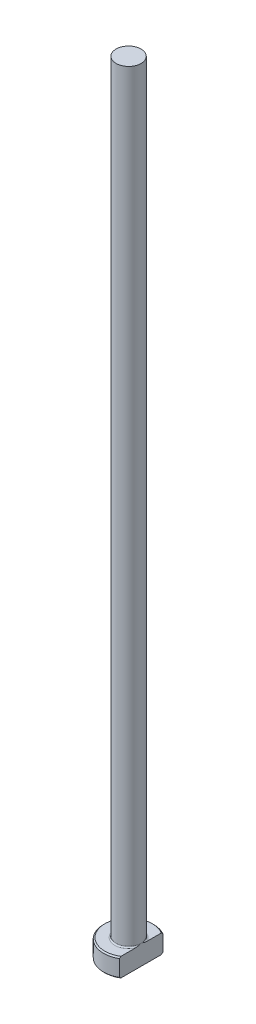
from build123d import *
from build123d.topology import SkipClean

# Parameters (mm, degrees)
CHAMFER1_SIZE = 0.2
FILLET1_R     = 0.2
KEY_DEPTH     = 126.127934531


with BuildPart() as part:
    # Sketch1 → Revolve1 (revolve)
    with BuildSketch(Plane.XY, mode=Mode.PRIVATE) as revolve1_sk:
        Polygon((0, 0), (-4, 0), (-4, 3), (-2, 3), (-2, 125), (0, 125), align=None)
    revolve(revolve1_sk.sketch.rotate(Axis((0, 259.958771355, 0), (0, -1, 0)), 270), axis=Axis((0, 259.958771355, 0), (0, -1, 0)))

    # Chamfer1
    chamfer1_edges = [part.edges().sort_by_distance(p)[0] for p in [
        (0, 3, -4),
        (0, 0, -4),
    ]]
    chamfer(chamfer1_edges, length=CHAMFER1_SIZE)

    # Fillet1
    fillet1_edges = [part.edges().sort_by_distance(p)[0] for p in [
        (0, 3, -2),
    ]]
    fillet(fillet1_edges, radius=FILLET1_R)

    # Sketch2 → KEY (cut, through all)
    with SkipClean():  # the faces are left unmerged after this step: merging them gives an invalid solid
        with BuildSketch(Plane(origin=(0, 0, 0), x_dir=(1, 0, 0), z_dir=(0, 1, 0))):
            with BuildLine():
                Line((2, 3.464101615), (2, -3.464101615))
                ThreePointArc((2, -3.464101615), (4, 0), (2, 3.464101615))
            make_face()
        extrude(amount=KEY_DEPTH, mode=Mode.SUBTRACT)


solid = part.part
